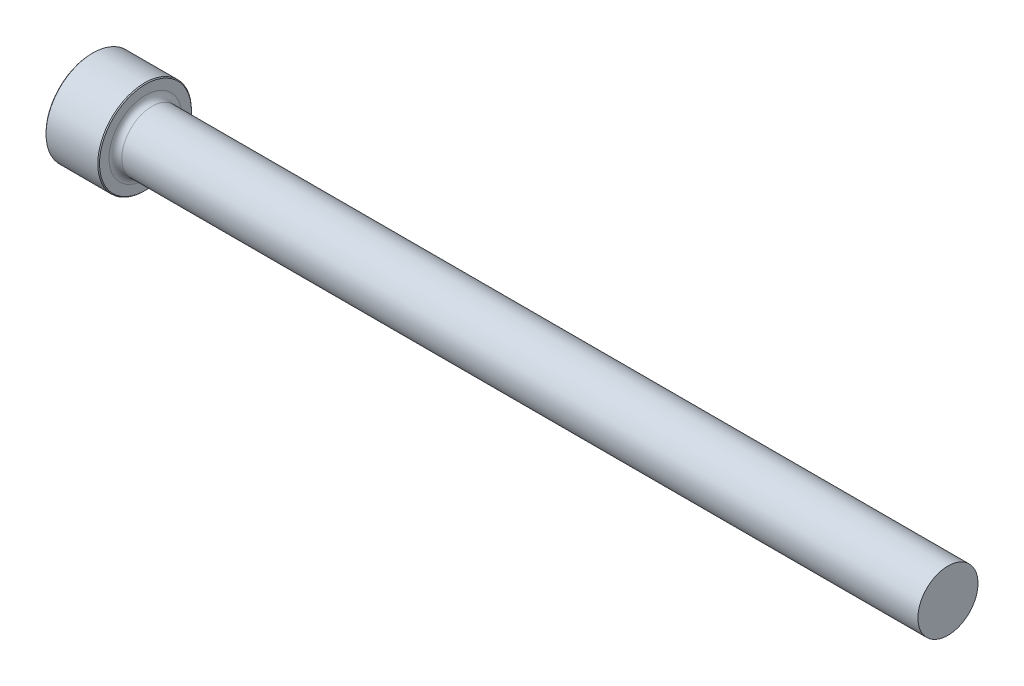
from build123d import *

# Parameters (mm, degrees)
CHAMFER1_SIZE = 0.1016


with BuildPart() as part:
    # Sketch1 → Revolve1 (revolve)
    with BuildSketch(Plane.XY):
        with BuildLine():
            Line((0, 0), (0, 5.55625))
            Line((0, 5.55625), (6.35, 5.55625))
            Line((6.35, 5.55625), (6.35, 4.330065))
            ThreePointArc((6.35, 4.330065), (6.573184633, 3.791249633), (7.112, 3.568065))
            Line((7.112, 3.568065), (101.6, 3.568065))
            Line((101.6, 3.568065), (101.6, 0))
            Line((101.6, 0), (0, 0))
        make_face()
    revolve(axis=Axis((101.6, 0, 0), (-1, 0, 0)))

    # Chamfer1
    chamfer1_edges = [part.edges().sort_by_distance(p)[0] for p in [
        (0, -5.55625, 0),
        (6.35, -5.55625, 0),
    ]]
    chamfer(chamfer1_edges, length=CHAMFER1_SIZE)


solid = part.part
